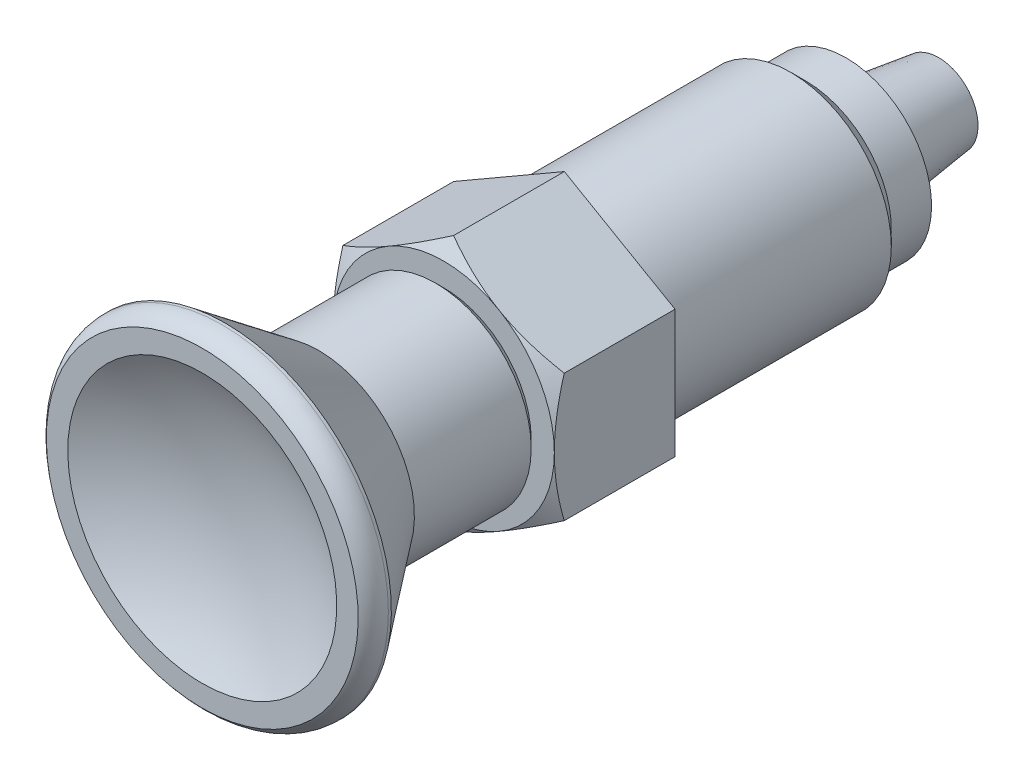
ISO-10303-21;
HEADER;
FILE_DESCRIPTION(('STEP AP214'),'2;1');
FILE_NAME('part.step','',(''),(''),'','','');
FILE_SCHEMA(('AUTOMOTIVE_DESIGN { 1 0 10303 214 1 1 1 1 }'));
ENDSEC;
DATA;
#1=APPLICATION_CONTEXT('core data for automotive mechanical design processes');
#2=APPLICATION_PROTOCOL_DEFINITION('international standard','automotive_design',2000,#1);
#3=PRODUCT_CONTEXT('',#1,'mechanical');
#4=PRODUCT('Part','Part','',(#3));
#5=PRODUCT_RELATED_PRODUCT_CATEGORY('part','',(#4));
#6=PRODUCT_DEFINITION_FORMATION('','',#4);
#7=PRODUCT_DEFINITION_CONTEXT('part definition',#1,'design');
#8=PRODUCT_DEFINITION('design','',#6,#7);
#9=PRODUCT_DEFINITION_SHAPE('','',#8);
#10=(LENGTH_UNIT() NAMED_UNIT(*) SI_UNIT(.MILLI.,.METRE.));
#11=(NAMED_UNIT(*) PLANE_ANGLE_UNIT() SI_UNIT($,.RADIAN.));
#12=(NAMED_UNIT(*) SI_UNIT($,.STERADIAN.) SOLID_ANGLE_UNIT());
#13=UNCERTAINTY_MEASURE_WITH_UNIT(LENGTH_MEASURE(1.E-05),#10,'distance_accuracy_value','');
#14=(GEOMETRIC_REPRESENTATION_CONTEXT(3) GLOBAL_UNCERTAINTY_ASSIGNED_CONTEXT((#13)) GLOBAL_UNIT_ASSIGNED_CONTEXT((#10,
#11,#12)) REPRESENTATION_CONTEXT('',''));
#15=CARTESIAN_POINT('',(0.,0.,0.));
#16=DIRECTION('',(0.,0.,1.));
#17=DIRECTION('',(1.,0.,0.));
#18=AXIS2_PLACEMENT_3D('',#15,#16,#17);
#19=CARTESIAN_POINT('',(0.,0.,-28.));
#20=DIRECTION('',(0.,0.,1.));
#21=DIRECTION('',(0.,1.,0.));
#22=AXIS2_PLACEMENT_3D('',#19,#20,#21);
#23=CYLINDRICAL_SURFACE('',#22,10.);
#24=CARTESIAN_POINT('',(0.,0.,0.));
#25=DIRECTION('',(0.,0.,1.));
#26=DIRECTION('',(0.,1.,0.));
#27=AXIS2_PLACEMENT_3D('',#24,#25,#26);
#28=CIRCLE('',#27,10.);
#29=CARTESIAN_POINT('',(0.,10.,0.));
#30=VERTEX_POINT('',#29);
#31=EDGE_CURVE('E359',#30,#30,#28,.T.);
#32=ORIENTED_EDGE('',*,*,#31,.F.);
#33=EDGE_LOOP('',(#32));
#34=FACE_BOUND('',#33,.T.);
#35=CARTESIAN_POINT('',(0.,0.,-22.5));
#36=DIRECTION('',(0.,0.,1.));
#37=DIRECTION('',(0.,1.,0.));
#38=AXIS2_PLACEMENT_3D('',#35,#36,#37);
#39=CIRCLE('',#38,10.);
#40=CARTESIAN_POINT('',(0.,10.,-22.5));
#41=VERTEX_POINT('',#40);
#42=EDGE_CURVE('E362',#41,#41,#39,.T.);
#43=ORIENTED_EDGE('',*,*,#42,.T.);
#44=EDGE_LOOP('',(#43));
#45=FACE_BOUND('',#44,.T.);
#46=ADVANCED_FACE('F14',(#34,#45),#23,.T.);
#47=CARTESIAN_POINT('',(-10.,0.,0.));
#48=DIRECTION('',(0.,0.,-1.));
#49=DIRECTION('',(0.,-1.,0.));
#50=AXIS2_PLACEMENT_3D('',#47,#48,#49);
#51=PLANE('',#50);
#52=ORIENTED_EDGE('',*,*,#31,.T.);
#53=EDGE_LOOP('',(#52));
#54=FACE_BOUND('',#53,.T.);
#55=DIRECTION('',(0.,1.,0.));
#56=VECTOR('',#55,1.);
#57=CARTESIAN_POINT('',(11.,-6.35085296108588,0.));
#58=LINE('',#57,#56);
#59=CARTESIAN_POINT('',(11.,-6.35085296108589,0.));
#60=VERTEX_POINT('',#59);
#61=CARTESIAN_POINT('',(11.,6.35085296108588,0.));
#62=VERTEX_POINT('',#61);
#63=EDGE_CURVE('E425',#60,#62,#58,.T.);
#64=ORIENTED_EDGE('',*,*,#63,.F.);
#65=DIRECTION('',(0.866025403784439,0.5,0.));
#66=VECTOR('',#65,1.);
#67=CARTESIAN_POINT('',(0.,-12.7017059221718,0.));
#68=LINE('',#67,#66);
#69=CARTESIAN_POINT('',(0.,-12.7017059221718,0.));
#70=VERTEX_POINT('',#69);
#71=EDGE_CURVE('E430',#70,#60,#68,.T.);
#72=ORIENTED_EDGE('',*,*,#71,.F.);
#73=DIRECTION('',(0.866025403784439,-0.5,0.));
#74=VECTOR('',#73,1.);
#75=CARTESIAN_POINT('',(-11.,-6.35085296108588,0.));
#76=LINE('',#75,#74);
#77=CARTESIAN_POINT('',(-11.,-6.35085296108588,0.));
#78=VERTEX_POINT('',#77);
#79=EDGE_CURVE('E376',#78,#70,#76,.T.);
#80=ORIENTED_EDGE('',*,*,#79,.F.);
#81=DIRECTION('',(0.,-1.,0.));
#82=VECTOR('',#81,1.);
#83=CARTESIAN_POINT('',(-11.,6.35085296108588,0.));
#84=LINE('',#83,#82);
#85=CARTESIAN_POINT('',(-11.,6.35085296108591,0.));
#86=VERTEX_POINT('',#85);
#87=EDGE_CURVE('E361',#86,#78,#84,.T.);
#88=ORIENTED_EDGE('',*,*,#87,.F.);
#89=DIRECTION('',(-0.866025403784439,-0.5,0.));
#90=VECTOR('',#89,1.);
#91=CARTESIAN_POINT('',(0.,12.7017059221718,0.));
#92=LINE('',#91,#90);
#93=CARTESIAN_POINT('',(0.,12.7017059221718,0.));
#94=VERTEX_POINT('',#93);
#95=EDGE_CURVE('E80',#94,#86,#92,.T.);
#96=ORIENTED_EDGE('',*,*,#95,.F.);
#97=DIRECTION('',(-0.866025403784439,0.5,0.));
#98=VECTOR('',#97,1.);
#99=CARTESIAN_POINT('',(11.,6.35085296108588,0.));
#100=LINE('',#99,#98);
#101=EDGE_CURVE('E77',#62,#94,#100,.T.);
#102=ORIENTED_EDGE('',*,*,#101,.F.);
#103=EDGE_LOOP('',(#64,#72,#80,#88,#96,#102));
#104=FACE_BOUND('',#103,.T.);
#105=ADVANCED_FACE('F196',(#54,#104),#51,.T.);
#106=CARTESIAN_POINT('',(-11.,6.35085296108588,0.));
#107=DIRECTION('',(-1.,0.,0.));
#108=DIRECTION('',(0.,-1.,0.));
#109=AXIS2_PLACEMENT_3D('',#106,#107,#108);
#110=PLANE('',#109);
#111=CARTESIAN_POINT('',(-11.,0.,12.));
#112=CARTESIAN_POINT('',(-11.,-0.269557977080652,12.0000452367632));
#113=CARTESIAN_POINT('',(-11.,-0.539103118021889,11.9942806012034));
#114=CARTESIAN_POINT('',(-11.,-1.07766414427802,11.9714665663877));
#115=CARTESIAN_POINT('',(-11.,-1.34668012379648,11.9544194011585));
#116=CARTESIAN_POINT('',(-11.,-1.88244489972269,11.9094875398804));
#117=CARTESIAN_POINT('',(-11.,-2.14919830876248,11.8816574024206));
#118=CARTESIAN_POINT('',(-11.,-2.68143540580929,11.8157540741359));
#119=CARTESIAN_POINT('',(-11.,-2.94691906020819,11.7776806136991));
#120=CARTESIAN_POINT('',(-11.,-3.47602099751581,11.692067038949));
#121=CARTESIAN_POINT('',(-11.,-3.73964114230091,11.6445383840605));
#122=CARTESIAN_POINT('',(-11.,-4.26516468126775,11.5407957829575));
#123=CARTESIAN_POINT('',(-11.,-4.52706796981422,11.4845813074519));
#124=CARTESIAN_POINT('',(-11.,-5.31266882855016,11.3035576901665));
#125=CARTESIAN_POINT('',(-11.,-5.83365883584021,11.1668042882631));
#126=CARTESIAN_POINT('',(-11.,-6.35085287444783,11.0175196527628));
#127=B_SPLINE_CURVE_WITH_KNOTS('',3,(#111,#112,#113,#114,#115,#116,#117,#118,#119,#120,#121,
#122,#123,#124,#125,#126),.UNSPECIFIED.,.F.,.F.,(4,2,2,2,2,2,2,4),(0.,0.808591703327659,
1.61702334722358,2.42141689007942,3.22583160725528,4.02927727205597,4.83277191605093,
6.44765254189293),.UNSPECIFIED.);
#128=CARTESIAN_POINT('',(-11.,0.,12.));
#129=VERTEX_POINT('',#128);
#130=CARTESIAN_POINT('',(-11.0000000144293,-6.35085295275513,11.0175196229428));
#131=VERTEX_POINT('',#130);
#132=EDGE_CURVE('E200',#129,#131,#127,.T.);
#133=ORIENTED_EDGE('',*,*,#132,.F.);
#134=CARTESIAN_POINT('',(-10.9999999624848,6.3508529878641,11.0175195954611));
#135=CARTESIAN_POINT('',(-10.9999999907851,5.8336589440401,11.1668042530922));
#136=CARTESIAN_POINT('',(-10.9999999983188,5.31266892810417,11.3035576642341));
#137=CARTESIAN_POINT('',(-11.0000000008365,4.52706805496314,11.4845812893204));
#138=CARTESIAN_POINT('',(-11.0000000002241,4.26516476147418,11.540795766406));
#139=CARTESIAN_POINT('',(-10.9999999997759,3.7396412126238,11.644538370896));
#140=CARTESIAN_POINT('',(-10.9999999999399,3.47602106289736,11.6920670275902));
#141=CARTESIAN_POINT('',(-11.0000000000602,2.94691911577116,11.7776806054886));
#142=CARTESIAN_POINT('',(-11.0000000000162,2.68143545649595,11.8157540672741));
#143=CARTESIAN_POINT('',(-10.9999999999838,2.14919834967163,11.8816573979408));
#144=CARTESIAN_POINT('',(-10.9999999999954,1.88244493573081,11.9094875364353));
#145=CARTESIAN_POINT('',(-11.0000000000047,1.34668014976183,11.9544193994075));
#146=CARTESIAN_POINT('',(-11.0000000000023,1.07766416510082,11.9714665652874));
#147=CARTESIAN_POINT('',(-10.9999999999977,0.539103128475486,11.9942806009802));
#148=CARTESIAN_POINT('',(-10.9999999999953,0.269557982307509,12.0000452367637));
#149=CARTESIAN_POINT('',(-11.,0.,12.));
#150=B_SPLINE_CURVE_WITH_KNOTS('',3,(#134,#135,#136,#137,#138,#139,#140,#141,#142,#143,#144,
#145,#146,#147,#148,#149),.UNSPECIFIED.,.F.,.F.,(4,2,2,2,2,2,2,4),(0.,1.61488065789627,
2.41837531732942,3.22182099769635,4.02623572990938,4.83062928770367,5.63906094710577,
6.44765266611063),.UNSPECIFIED.);
#151=CARTESIAN_POINT('',(-11.,6.35085297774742,11.0175196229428));
#152=VERTEX_POINT('',#151);
#153=EDGE_CURVE('E206',#152,#129,#150,.T.);
#154=ORIENTED_EDGE('',*,*,#153,.F.);
#155=DIRECTION('',(0.,0.,1.));
#156=VECTOR('',#155,1.);
#157=CARTESIAN_POINT('',(-11.,6.35085296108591,0.));
#158=LINE('',#157,#156);
#159=EDGE_CURVE('E264',#86,#152,#158,.T.);
#160=ORIENTED_EDGE('',*,*,#159,.F.);
#161=ORIENTED_EDGE('',*,*,#87,.T.);
#162=DIRECTION('',(0.,0.,1.));
#163=VECTOR('',#162,1.);
#164=CARTESIAN_POINT('',(-11.,-6.35085296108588,0.));
#165=LINE('',#164,#163);
#166=EDGE_CURVE('E366',#131,#78,#165,.F.);
#167=ORIENTED_EDGE('',*,*,#166,.F.);
#168=EDGE_LOOP('',(#133,#154,#160,#161,#167));
#169=FACE_BOUND('',#168,.T.);
#170=ADVANCED_FACE('F190',(#169),#110,.T.);
#171=CARTESIAN_POINT('',(-11.,-6.35085296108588,0.));
#172=DIRECTION('',(-0.5,-0.866025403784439,0.));
#173=DIRECTION('',(0.866025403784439,-0.5,0.));
#174=AXIS2_PLACEMENT_3D('',#171,#172,#173);
#175=PLANE('',#174);
#176=CARTESIAN_POINT('',(-5.5,-9.52627944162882,12.));
#177=CARTESIAN_POINT('',(-5.26655594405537,-9.66105843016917,12.0000452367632));
#178=CARTESIAN_POINT('',(-5.03312300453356,-9.79583100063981,11.9942806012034));
#179=CARTESIAN_POINT('',(-4.56671547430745,-10.0651115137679,11.9714665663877));
#180=CARTESIAN_POINT('',(-4.33374080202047,-10.1996195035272,11.9544194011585));
#181=CARTESIAN_POINT('',(-3.86975489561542,-10.4675018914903,11.9094875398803));
#182=CARTESIAN_POINT('',(-3.63873966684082,-10.6008785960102,11.8816574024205));
#183=CARTESIAN_POINT('',(-3.17780881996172,-10.8669971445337,11.8157540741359));
#184=CARTESIAN_POINT('',(-2.9478932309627,-10.9997389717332,11.777680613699));
#185=CARTESIAN_POINT('',(-2.48967751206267,-11.264289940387,11.6920670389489));
#186=CARTESIAN_POINT('',(-2.2613757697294,-11.3961000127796,11.6445383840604));
#187=CARTESIAN_POINT('',(-1.80625903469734,-11.6588617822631,11.5407957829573));
#188=CARTESIAN_POINT('',(-1.57944413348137,-11.7898134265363,11.4845813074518));
#189=CARTESIAN_POINT('',(-0.899093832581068,-12.1826138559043,11.3035576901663));
#190=CARTESIAN_POINT('',(-0.447903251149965,-12.4431088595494,11.1668042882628));
#191=CARTESIAN_POINT('',(-7.50298244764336E-08,-12.7017058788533,11.0175196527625));
#192=B_SPLINE_CURVE_WITH_KNOTS('',3,(#176,#177,#178,#179,#180,#181,#182,#183,#184,#185,#186,
#187,#188,#189,#190,#191),.UNSPECIFIED.,.F.,.F.,(4,2,2,2,2,2,2,4),(0.,0.8085917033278,
1.61702334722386,2.42141689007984,3.22583160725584,4.02927727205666,4.83277191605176,
6.44765254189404),.UNSPECIFIED.);
#193=CARTESIAN_POINT('',(-5.5,-9.52627944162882,12.));
#194=VERTEX_POINT('',#193);
#195=CARTESIAN_POINT('',(-1.4428809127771E-08,-12.7017059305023,11.0175196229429));
#196=VERTEX_POINT('',#195);
#197=EDGE_CURVE('E173',#194,#196,#192,.T.);
#198=ORIENTED_EDGE('',*,*,#197,.F.);
#199=CARTESIAN_POINT('',(-11.000000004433,-6.35085291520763,11.0175195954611));
#200=CARTESIAN_POINT('',(-10.5520968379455,-6.60944996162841,11.1668042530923));
#201=CARTESIAN_POINT('',(-10.1009062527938,-6.86994497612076,11.3035576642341));
#202=CARTESIAN_POINT('',(-9.42055594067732,-7.2627454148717,11.4845812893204));
#203=CARTESIAN_POINT('',(-9.1937410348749,-7.39369706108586,11.540795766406));
#204=CARTESIAN_POINT('',(-8.73862429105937,-7.65645883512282,11.644538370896));
#205=CARTESIAN_POINT('',(-8.51032254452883,-7.78826891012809,11.6920670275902));
#206=CARTESIAN_POINT('',(-8.05210681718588,-8.05281988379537,11.7776806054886));
#207=CARTESIAN_POINT('',(-7.82219122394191,-8.18556171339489,11.8157540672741));
#208=CARTESIAN_POINT('',(-7.36126036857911,-8.45168026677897,11.8816573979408));
#209=CARTESIAN_POINT('',(-7.13024513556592,-8.5850569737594,11.9094875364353));
#210=CARTESIAN_POINT('',(-6.6662592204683,-8.85293936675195,11.9544193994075));
#211=CARTESIAN_POINT('',(-6.43328454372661,-8.98744735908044,11.9714665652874));
#212=CARTESIAN_POINT('',(-5.96687700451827,-9.25672787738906,11.9942806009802));
#213=CARTESIAN_POINT('',(-5.73344406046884,-9.39150045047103,12.0000452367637));
#214=CARTESIAN_POINT('',(-5.5,-9.52627944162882,12.));
#215=B_SPLINE_CURVE_WITH_KNOTS('',3,(#199,#200,#201,#202,#203,#204,#205,#206,#207,#208,#209,
#210,#211,#212,#213,#214),.UNSPECIFIED.,.F.,.F.,(4,2,2,2,2,2,2,4),(0.,1.61488065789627,
2.41837531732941,3.22182099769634,4.02623572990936,4.83062928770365,5.63906094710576,
6.44765266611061),.UNSPECIFIED.);
#216=EDGE_CURVE('E180',#131,#194,#215,.T.);
#217=ORIENTED_EDGE('',*,*,#216,.F.);
#218=ORIENTED_EDGE('',*,*,#166,.T.);
#219=ORIENTED_EDGE('',*,*,#79,.T.);
#220=DIRECTION('',(0.,0.,1.));
#221=VECTOR('',#220,1.);
#222=CARTESIAN_POINT('',(0.,-12.7017059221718,0.));
#223=LINE('',#222,#221);
#224=EDGE_CURVE('E441',#196,#70,#223,.F.);
#225=ORIENTED_EDGE('',*,*,#224,.F.);
#226=EDGE_LOOP('',(#198,#217,#218,#219,#225));
#227=FACE_BOUND('',#226,.T.);
#228=ADVANCED_FACE('F186',(#227),#175,.T.);
#229=CARTESIAN_POINT('',(0.,-12.7017059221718,0.));
#230=DIRECTION('',(0.5,-0.866025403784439,0.));
#231=DIRECTION('',(0.866025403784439,0.5,0.));
#232=AXIS2_PLACEMENT_3D('',#229,#230,#231);
#233=PLANE('',#232);
#234=CARTESIAN_POINT('',(5.5,-9.52627944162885,12.));
#235=CARTESIAN_POINT('',(5.73344405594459,-9.39150045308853,12.0000452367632));
#236=CARTESIAN_POINT('',(5.96687699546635,-9.25672788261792,11.9942806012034));
#237=CARTESIAN_POINT('',(6.43328452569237,-8.98744736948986,11.9714665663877));
#238=CARTESIAN_POINT('',(6.66625919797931,-8.85293937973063,11.9544194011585));
#239=CARTESIAN_POINT('',(7.13024510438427,-8.58505699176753,11.9094875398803));
#240=CARTESIAN_POINT('',(7.36126033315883,-8.45168028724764,11.8816574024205));
#241=CARTESIAN_POINT('',(7.82219118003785,-8.18556173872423,11.8157540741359));
#242=CARTESIAN_POINT('',(8.05210676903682,-8.05281991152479,11.7776806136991));
#243=CARTESIAN_POINT('',(8.51032248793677,-7.78826894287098,11.692067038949));
#244=CARTESIAN_POINT('',(8.73862423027,-7.65645887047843,11.6445383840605));
#245=CARTESIAN_POINT('',(9.19374096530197,-7.39369710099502,11.5407957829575));
#246=CARTESIAN_POINT('',(9.4205558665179,-7.26274545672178,11.4845813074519));
#247=CARTESIAN_POINT('',(10.1009061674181,-6.86994502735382,11.3035576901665));
#248=CARTESIAN_POINT('',(10.5520967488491,-6.6094500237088,11.1668042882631));
#249=CARTESIAN_POINT('',(10.9999999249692,-6.35085300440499,11.0175196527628));
#250=B_SPLINE_CURVE_WITH_KNOTS('',3,(#234,#235,#236,#237,#238,#239,#240,#241,#242,#243,#244,
#245,#246,#247,#248,#249),.UNSPECIFIED.,.F.,.F.,(4,2,2,2,2,2,2,4),(0.,0.808591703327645,
1.61702334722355,2.42141689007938,3.22583160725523,4.0292772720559,4.83277191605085,
6.44765254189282),.UNSPECIFIED.);
#251=CARTESIAN_POINT('',(5.5,-9.52627944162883,12.));
#252=VERTEX_POINT('',#251);
#253=CARTESIAN_POINT('',(11.,-6.35085297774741,11.0175196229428));
#254=VERTEX_POINT('',#253);
#255=EDGE_CURVE('E145',#252,#254,#250,.T.);
#256=ORIENTED_EDGE('',*,*,#255,.F.);
#257=CARTESIAN_POINT('',(-4.19471447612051E-08,-12.7017059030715,11.0175195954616));
#258=CARTESIAN_POINT('',(0.447903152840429,-12.4431089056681,11.1668042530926));
#259=CARTESIAN_POINT('',(0.89909374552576,-12.1826139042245,11.3035576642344));
#260=CARTESIAN_POINT('',(1.57944406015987,-11.7898134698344,11.4845812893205));
#261=CARTESIAN_POINT('',(1.8062589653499,-11.6588618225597,11.5407957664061));
#262=CARTESIAN_POINT('',(2.26137570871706,-11.3961000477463,11.6445383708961));
#263=CARTESIAN_POINT('',(2.48967745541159,-11.2642899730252,11.6920670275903));
#264=CARTESIAN_POINT('',(2.94789318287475,-10.9997389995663,11.7776806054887));
#265=CARTESIAN_POINT('',(3.17780877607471,-10.8669971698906,11.8157540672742));
#266=CARTESIAN_POINT('',(3.63873963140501,-10.6008786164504,11.8816573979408));
#267=CARTESIAN_POINT('',(3.86975486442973,-10.4675019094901,11.9094875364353));
#268=CARTESIAN_POINT('',(4.33374077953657,-10.1996195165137,11.9544193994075));
#269=CARTESIAN_POINT('',(4.56671545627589,-10.0651115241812,11.9714665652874));
#270=CARTESIAN_POINT('',(5.03312299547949,-9.79583100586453,11.9942806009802));
#271=CARTESIAN_POINT('',(5.26655593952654,-9.66105843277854,12.0000452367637));
#272=CARTESIAN_POINT('',(5.5,-9.52627944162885,12.));
#273=B_SPLINE_CURVE_WITH_KNOTS('',3,(#257,#258,#259,#260,#261,#262,#263,#264,#265,#266,#267,
#268,#269,#270,#271,#272),.UNSPECIFIED.,.F.,.F.,(4,2,2,2,2,2,2,4),(0.,1.61488065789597,
2.41837531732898,3.22182099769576,4.02623572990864,4.83062928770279,5.63906094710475,
6.44765266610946),.UNSPECIFIED.);
#274=EDGE_CURVE('E167',#196,#252,#273,.T.);
#275=ORIENTED_EDGE('',*,*,#274,.F.);
#276=ORIENTED_EDGE('',*,*,#224,.T.);
#277=ORIENTED_EDGE('',*,*,#71,.T.);
#278=DIRECTION('',(0.,0.,1.));
#279=VECTOR('',#278,1.);
#280=CARTESIAN_POINT('',(11.,-6.35085296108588,0.));
#281=LINE('',#280,#279);
#282=EDGE_CURVE('E435',#254,#60,#281,.F.);
#283=ORIENTED_EDGE('',*,*,#282,.F.);
#284=EDGE_LOOP('',(#256,#275,#276,#277,#283));
#285=FACE_BOUND('',#284,.T.);
#286=ADVANCED_FACE('F127',(#285),#233,.T.);
#287=CARTESIAN_POINT('',(11.,-6.35085296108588,0.));
#288=DIRECTION('',(1.,0.,0.));
#289=DIRECTION('',(0.,1.,0.));
#290=AXIS2_PLACEMENT_3D('',#287,#288,#289);
#291=PLANE('',#290);
#292=CARTESIAN_POINT('',(11.,0.,12.));
#293=CARTESIAN_POINT('',(11.,0.269557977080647,12.0000452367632));
#294=CARTESIAN_POINT('',(11.,0.539103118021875,11.9942806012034));
#295=CARTESIAN_POINT('',(11.,1.07766414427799,11.9714665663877));
#296=CARTESIAN_POINT('',(11.,1.34668012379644,11.9544194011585));
#297=CARTESIAN_POINT('',(11.,1.88244489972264,11.9094875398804));
#298=CARTESIAN_POINT('',(11.,2.14919830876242,11.8816574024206));
#299=CARTESIAN_POINT('',(11.,2.68143540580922,11.8157540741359));
#300=CARTESIAN_POINT('',(11.,2.94691906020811,11.7776806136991));
#301=CARTESIAN_POINT('',(11.,3.47602099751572,11.692067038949));
#302=CARTESIAN_POINT('',(11.,3.73964114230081,11.6445383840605));
#303=CARTESIAN_POINT('',(11.,4.26516468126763,11.5407957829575));
#304=CARTESIAN_POINT('',(11.,4.5270679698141,11.484581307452));
#305=CARTESIAN_POINT('',(11.,5.31266882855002,11.3035576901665));
#306=CARTESIAN_POINT('',(11.,5.83365883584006,11.1668042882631));
#307=CARTESIAN_POINT('',(11.,6.35085287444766,11.0175196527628));
#308=B_SPLINE_CURVE_WITH_KNOTS('',3,(#292,#293,#294,#295,#296,#297,#298,#299,#300,#301,#302,
#303,#304,#305,#306,#307),.UNSPECIFIED.,.F.,.F.,(4,2,2,2,2,2,2,4),(0.,0.808591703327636,
1.61702334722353,2.42141689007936,3.22583160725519,4.02927727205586,4.8327719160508,
6.44765254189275),.UNSPECIFIED.);
#309=CARTESIAN_POINT('',(11.,0.,12.));
#310=VERTEX_POINT('',#309);
#311=CARTESIAN_POINT('',(11.0000000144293,6.35085295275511,11.0175196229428));
#312=VERTEX_POINT('',#311);
#313=EDGE_CURVE('E95',#310,#312,#308,.T.);
#314=ORIENTED_EDGE('',*,*,#313,.F.);
#315=CARTESIAN_POINT('',(10.9999999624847,-6.35085298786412,11.017519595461));
#316=CARTESIAN_POINT('',(10.999999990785,-5.83365894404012,11.1668042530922));
#317=CARTESIAN_POINT('',(10.9999999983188,-5.31266892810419,11.3035576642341));
#318=CARTESIAN_POINT('',(11.0000000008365,-4.52706805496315,11.4845812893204));
#319=CARTESIAN_POINT('',(11.0000000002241,-4.26516476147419,11.5407957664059));
#320=CARTESIAN_POINT('',(10.9999999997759,-3.73964121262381,11.644538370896));
#321=CARTESIAN_POINT('',(10.9999999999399,-3.47602106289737,11.6920670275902));
#322=CARTESIAN_POINT('',(11.0000000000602,-2.94691911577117,11.7776806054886));
#323=CARTESIAN_POINT('',(11.0000000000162,-2.68143545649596,11.8157540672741));
#324=CARTESIAN_POINT('',(10.9999999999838,-2.14919834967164,11.8816573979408));
#325=CARTESIAN_POINT('',(10.9999999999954,-1.88244493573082,11.9094875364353));
#326=CARTESIAN_POINT('',(11.0000000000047,-1.34668014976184,11.9544193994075));
#327=CARTESIAN_POINT('',(11.0000000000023,-1.07766416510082,11.9714665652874));
#328=CARTESIAN_POINT('',(10.9999999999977,-0.539103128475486,11.9942806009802));
#329=CARTESIAN_POINT('',(10.9999999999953,-0.269557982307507,12.0000452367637));
#330=CARTESIAN_POINT('',(11.,0.,12.));
#331=B_SPLINE_CURVE_WITH_KNOTS('',3,(#315,#316,#317,#318,#319,#320,#321,#322,#323,#324,#325,
#326,#327,#328,#329,#330),.UNSPECIFIED.,.F.,.F.,(4,2,2,2,2,2,2,4),(0.,1.61488065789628,
2.41837531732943,3.22182099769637,4.0262357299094,4.83062928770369,5.6390609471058,
6.44765266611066),.UNSPECIFIED.);
#332=EDGE_CURVE('E137',#254,#310,#331,.T.);
#333=ORIENTED_EDGE('',*,*,#332,.F.);
#334=ORIENTED_EDGE('',*,*,#282,.T.);
#335=ORIENTED_EDGE('',*,*,#63,.T.);
#336=DIRECTION('',(0.,0.,1.));
#337=VECTOR('',#336,1.);
#338=CARTESIAN_POINT('',(11.,6.35085296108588,0.));
#339=LINE('',#338,#337);
#340=EDGE_CURVE('E434',#312,#62,#339,.F.);
#341=ORIENTED_EDGE('',*,*,#340,.F.);
#342=EDGE_LOOP('',(#314,#333,#334,#335,#341));
#343=FACE_BOUND('',#342,.T.);
#344=ADVANCED_FACE('F120',(#343),#291,.T.);
#345=CARTESIAN_POINT('',(11.,6.35085296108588,0.));
#346=DIRECTION('',(0.5,0.866025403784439,0.));
#347=DIRECTION('',(-0.866025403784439,0.5,0.));
#348=AXIS2_PLACEMENT_3D('',#345,#346,#347);
#349=PLANE('',#348);
#350=CARTESIAN_POINT('',(5.5,9.52627944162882,12.));
#351=CARTESIAN_POINT('',(5.26655594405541,9.66105843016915,12.0000452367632));
#352=CARTESIAN_POINT('',(5.03312300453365,9.79583100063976,11.9942806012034));
#353=CARTESIAN_POINT('',(4.56671547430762,10.0651115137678,11.9714665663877));
#354=CARTESIAN_POINT('',(4.33374080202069,10.1996195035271,11.9544194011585));
#355=CARTESIAN_POINT('',(3.86975489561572,10.4675018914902,11.9094875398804));
#356=CARTESIAN_POINT('',(3.63873966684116,10.60087859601,11.8816574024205));
#357=CARTESIAN_POINT('',(3.17780881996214,10.8669971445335,11.8157540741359));
#358=CARTESIAN_POINT('',(2.94789323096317,10.9997389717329,11.7776806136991));
#359=CARTESIAN_POINT('',(2.48967751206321,11.2642899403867,11.692067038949));
#360=CARTESIAN_POINT('',(2.26137576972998,11.3961000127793,11.6445383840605));
#361=CARTESIAN_POINT('',(1.80625903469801,11.6588617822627,11.5407957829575));
#362=CARTESIAN_POINT('',(1.57944413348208,11.7898134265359,11.484581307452));
#363=CARTESIAN_POINT('',(0.899093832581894,12.1826138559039,11.3035576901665));
#364=CARTESIAN_POINT('',(0.447903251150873,12.4431088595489,11.1668042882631));
#365=CARTESIAN_POINT('',(7.50308107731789E-08,12.7017058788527,11.0175196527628));
#366=B_SPLINE_CURVE_WITH_KNOTS('',3,(#350,#351,#352,#353,#354,#355,#356,#357,#358,#359,#360,
#361,#362,#363,#364,#365),.UNSPECIFIED.,.F.,.F.,(4,2,2,2,2,2,2,4),(0.,0.80859170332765,
1.61702334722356,2.4214168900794,3.22583160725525,4.02927727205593,4.83277191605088,
6.44765254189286),.UNSPECIFIED.);
#367=CARTESIAN_POINT('',(5.5,9.52627944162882,12.));
#368=VERTEX_POINT('',#367);
#369=CARTESIAN_POINT('',(1.44292992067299E-08,12.7017059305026,11.0175196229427));
#370=VERTEX_POINT('',#369);
#371=EDGE_CURVE('E34',#368,#370,#366,.T.);
#372=ORIENTED_EDGE('',*,*,#371,.F.);
#373=CARTESIAN_POINT('',(11.000000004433,6.35085291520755,11.017519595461));
#374=CARTESIAN_POINT('',(10.5520968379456,6.60944996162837,11.1668042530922));
#375=CARTESIAN_POINT('',(10.1009062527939,6.86994497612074,11.3035576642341));
#376=CARTESIAN_POINT('',(9.42055594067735,7.26274541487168,11.4845812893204));
#377=CARTESIAN_POINT('',(9.19374103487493,7.39369706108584,11.5407957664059));
#378=CARTESIAN_POINT('',(8.7386242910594,7.6564588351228,11.644538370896));
#379=CARTESIAN_POINT('',(8.51032254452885,7.78826891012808,11.6920670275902));
#380=CARTESIAN_POINT('',(8.0521068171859,8.05281988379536,11.7776806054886));
#381=CARTESIAN_POINT('',(7.82219122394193,8.18556171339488,11.8157540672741));
#382=CARTESIAN_POINT('',(7.36126036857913,8.45168026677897,11.8816573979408));
#383=CARTESIAN_POINT('',(7.13024513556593,8.58505697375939,11.9094875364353));
#384=CARTESIAN_POINT('',(6.66625922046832,8.85293936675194,11.9544193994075));
#385=CARTESIAN_POINT('',(6.43328454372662,8.98744735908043,11.9714665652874));
#386=CARTESIAN_POINT('',(5.96687700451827,9.25672787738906,11.9942806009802));
#387=CARTESIAN_POINT('',(5.73344406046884,9.39150045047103,12.0000452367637));
#388=CARTESIAN_POINT('',(5.5,9.52627944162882,12.));
#389=B_SPLINE_CURVE_WITH_KNOTS('',3,(#373,#374,#375,#376,#377,#378,#379,#380,#381,#382,#383,
#384,#385,#386,#387,#388),.UNSPECIFIED.,.F.,.F.,(4,2,2,2,2,2,2,4),(0.,1.61488065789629,
2.41837531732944,3.22182099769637,4.0262357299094,4.8306292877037,5.63906094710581,
6.44765266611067),.UNSPECIFIED.);
#390=EDGE_CURVE('E93',#312,#368,#389,.T.);
#391=ORIENTED_EDGE('',*,*,#390,.F.);
#392=ORIENTED_EDGE('',*,*,#340,.T.);
#393=ORIENTED_EDGE('',*,*,#101,.T.);
#394=DIRECTION('',(0.,0.,1.));
#395=VECTOR('',#394,1.);
#396=CARTESIAN_POINT('',(0.,12.7017059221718,0.));
#397=LINE('',#396,#395);
#398=EDGE_CURVE('E72',#370,#94,#397,.F.);
#399=ORIENTED_EDGE('',*,*,#398,.F.);
#400=EDGE_LOOP('',(#372,#391,#392,#393,#399));
#401=FACE_BOUND('',#400,.T.);
#402=ADVANCED_FACE('F73',(#401),#349,.T.);
#403=CARTESIAN_POINT('',(0.,12.7017059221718,0.));
#404=DIRECTION('',(-0.5,0.866025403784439,0.));
#405=DIRECTION('',(-0.866025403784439,-0.5,0.));
#406=AXIS2_PLACEMENT_3D('',#403,#404,#405);
#407=PLANE('',#406);
#408=CARTESIAN_POINT('',(-5.5,9.52627944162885,12.));
#409=CARTESIAN_POINT('',(-5.73344405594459,9.39150045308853,12.0000452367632));
#410=CARTESIAN_POINT('',(-5.96687699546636,9.25672788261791,11.9942806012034));
#411=CARTESIAN_POINT('',(-6.43328452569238,8.98744736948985,11.9714665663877));
#412=CARTESIAN_POINT('',(-6.66625919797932,8.85293937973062,11.9544194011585));
#413=CARTESIAN_POINT('',(-7.1302451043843,8.58505699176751,11.9094875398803));
#414=CARTESIAN_POINT('',(-7.36126033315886,8.45168028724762,11.8816574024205));
#415=CARTESIAN_POINT('',(-7.82219118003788,8.18556173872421,11.8157540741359));
#416=CARTESIAN_POINT('',(-8.05210676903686,8.05281991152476,11.7776806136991));
#417=CARTESIAN_POINT('',(-8.51032248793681,7.78826894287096,11.692067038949));
#418=CARTESIAN_POINT('',(-8.73862423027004,7.65645887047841,11.6445383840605));
#419=CARTESIAN_POINT('',(-9.19374096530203,7.39369710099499,11.5407957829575));
#420=CARTESIAN_POINT('',(-9.42055586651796,7.26274545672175,11.4845813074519));
#421=CARTESIAN_POINT('',(-10.1009061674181,6.86994502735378,11.3035576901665));
#422=CARTESIAN_POINT('',(-10.5520967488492,6.60945002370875,11.1668042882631));
#423=CARTESIAN_POINT('',(-10.9999999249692,6.35085300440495,11.0175196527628));
#424=B_SPLINE_CURVE_WITH_KNOTS('',3,(#408,#409,#410,#411,#412,#413,#414,#415,#416,#417,#418,
#419,#420,#421,#422,#423),.UNSPECIFIED.,.F.,.F.,(4,2,2,2,2,2,2,4),(0.,0.808591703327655,
1.61702334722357,2.42141689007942,3.22583160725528,4.02927727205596,4.83277191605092,
6.44765254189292),.UNSPECIFIED.);
#425=CARTESIAN_POINT('',(-5.5,9.52627944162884,12.));
#426=VERTEX_POINT('',#425);
#427=EDGE_CURVE('E68',#426,#152,#424,.T.);
#428=ORIENTED_EDGE('',*,*,#427,.F.);
#429=CARTESIAN_POINT('',(4.19482499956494E-08,12.7017059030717,11.017519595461));
#430=CARTESIAN_POINT('',(-0.447903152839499,12.4431089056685,11.1668042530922));
#431=CARTESIAN_POINT('',(-0.899093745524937,12.182613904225,11.3035576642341));
#432=CARTESIAN_POINT('',(-1.57944406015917,11.7898134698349,11.4845812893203));
#433=CARTESIAN_POINT('',(-1.80625896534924,11.6588618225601,11.5407957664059));
#434=CARTESIAN_POINT('',(-2.26137570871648,11.3961000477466,11.644538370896));
#435=CARTESIAN_POINT('',(-2.48967745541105,11.2642899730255,11.6920670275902));
#436=CARTESIAN_POINT('',(-2.9478931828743,10.9997389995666,11.7776806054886));
#437=CARTESIAN_POINT('',(-3.17780877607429,10.8669971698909,11.8157540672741));
#438=CARTESIAN_POINT('',(-3.63873963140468,10.6008786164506,11.8816573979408));
#439=CARTESIAN_POINT('',(-3.86975486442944,10.4675019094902,11.9094875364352));
#440=CARTESIAN_POINT('',(-4.33374077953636,10.1996195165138,11.9544193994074));
#441=CARTESIAN_POINT('',(-4.56671545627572,10.0651115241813,11.9714665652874));
#442=CARTESIAN_POINT('',(-5.0331229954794,9.79583100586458,11.9942806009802));
#443=CARTESIAN_POINT('',(-5.26655593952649,9.66105843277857,12.0000452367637));
#444=CARTESIAN_POINT('',(-5.5,9.52627944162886,12.));
#445=B_SPLINE_CURVE_WITH_KNOTS('',3,(#429,#430,#431,#432,#433,#434,#435,#436,#437,#438,#439,
#440,#441,#442,#443,#444),.UNSPECIFIED.,.F.,.F.,(4,2,2,2,2,2,2,4),(0.,1.61488065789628,
2.41837531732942,3.22182099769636,4.02623572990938,4.83062928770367,5.63906094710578,
6.44765266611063),.UNSPECIFIED.);
#446=EDGE_CURVE('E83',#370,#426,#445,.T.);
#447=ORIENTED_EDGE('',*,*,#446,.F.);
#448=ORIENTED_EDGE('',*,*,#398,.T.);
#449=ORIENTED_EDGE('',*,*,#95,.T.);
#450=ORIENTED_EDGE('',*,*,#159,.T.);
#451=EDGE_LOOP('',(#428,#447,#448,#449,#450));
#452=FACE_BOUND('',#451,.T.);
#453=ADVANCED_FACE('F84',(#452),#407,.T.);
#454=CARTESIAN_POINT('',(0.,0.,11.0116247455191));
#455=DIRECTION('',(0.,0.,-1.));
#456=DIRECTION('',(0.,-1.,0.));
#457=AXIS2_PLACEMENT_3D('',#454,#455,#456);
#458=CONICAL_SURFACE('',#457,12.7119161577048,1.0471975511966);
#459=ORIENTED_EDGE('',*,*,#153,.T.);
#460=CARTESIAN_POINT('',(0.,0.,12.));
#461=DIRECTION('',(0.,0.,-1.));
#462=DIRECTION('',(0.,-1.,0.));
#463=AXIS2_PLACEMENT_3D('',#460,#461,#462);
#464=CIRCLE('',#463,11.);
#465=EDGE_CURVE('E88',#426,#129,#464,.F.);
#466=ORIENTED_EDGE('',*,*,#465,.F.);
#467=ORIENTED_EDGE('',*,*,#427,.T.);
#468=EDGE_LOOP('',(#459,#466,#467));
#469=FACE_BOUND('',#468,.T.);
#470=ADVANCED_FACE('F218',(#469),#458,.T.);
#471=CARTESIAN_POINT('',(0.,0.,11.0116247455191));
#472=DIRECTION('',(0.,0.,-1.));
#473=DIRECTION('',(0.,-1.,0.));
#474=AXIS2_PLACEMENT_3D('',#471,#472,#473);
#475=CONICAL_SURFACE('',#474,12.7119161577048,1.0471975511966);
#476=ORIENTED_EDGE('',*,*,#132,.T.);
#477=ORIENTED_EDGE('',*,*,#216,.T.);
#478=CARTESIAN_POINT('',(0.,0.,12.));
#479=DIRECTION('',(0.,0.,-1.));
#480=DIRECTION('',(0.,-1.,0.));
#481=AXIS2_PLACEMENT_3D('',#478,#479,#480);
#482=CIRCLE('',#481,11.);
#483=EDGE_CURVE('E462',#129,#194,#482,.F.);
#484=ORIENTED_EDGE('',*,*,#483,.F.);
#485=EDGE_LOOP('',(#476,#477,#484));
#486=FACE_BOUND('',#485,.T.);
#487=ADVANCED_FACE('F163',(#486),#475,.T.);
#488=CARTESIAN_POINT('',(0.,0.,11.011624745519));
#489=DIRECTION('',(0.,0.,-1.));
#490=DIRECTION('',(-1.,0.,0.));
#491=AXIS2_PLACEMENT_3D('',#488,#489,#490);
#492=CONICAL_SURFACE('',#491,12.7119161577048,1.0471975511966);
#493=ORIENTED_EDGE('',*,*,#197,.T.);
#494=ORIENTED_EDGE('',*,*,#274,.T.);
#495=CARTESIAN_POINT('',(0.,0.,12.));
#496=DIRECTION('',(0.,0.,-1.));
#497=DIRECTION('',(-1.,0.,0.));
#498=AXIS2_PLACEMENT_3D('',#495,#496,#497);
#499=CIRCLE('',#498,11.);
#500=EDGE_CURVE('E460',#194,#252,#499,.F.);
#501=ORIENTED_EDGE('',*,*,#500,.F.);
#502=EDGE_LOOP('',(#493,#494,#501));
#503=FACE_BOUND('',#502,.T.);
#504=ADVANCED_FACE('F156',(#503),#492,.T.);
#505=CARTESIAN_POINT('',(0.,0.,11.0116247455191));
#506=DIRECTION('',(0.,0.,-1.));
#507=DIRECTION('',(0.,-1.,0.));
#508=AXIS2_PLACEMENT_3D('',#505,#506,#507);
#509=CONICAL_SURFACE('',#508,12.7119161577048,1.0471975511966);
#510=ORIENTED_EDGE('',*,*,#255,.T.);
#511=ORIENTED_EDGE('',*,*,#332,.T.);
#512=CARTESIAN_POINT('',(0.,0.,12.));
#513=DIRECTION('',(0.,0.,-1.));
#514=DIRECTION('',(0.,-1.,0.));
#515=AXIS2_PLACEMENT_3D('',#512,#513,#514);
#516=CIRCLE('',#515,11.);
#517=EDGE_CURVE('E454',#252,#310,#516,.F.);
#518=ORIENTED_EDGE('',*,*,#517,.F.);
#519=EDGE_LOOP('',(#510,#511,#518));
#520=FACE_BOUND('',#519,.T.);
#521=ADVANCED_FACE('F151',(#520),#509,.T.);
#522=CARTESIAN_POINT('',(0.,0.,11.0116247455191));
#523=DIRECTION('',(0.,0.,-1.));
#524=DIRECTION('',(0.,-1.,0.));
#525=AXIS2_PLACEMENT_3D('',#522,#523,#524);
#526=CONICAL_SURFACE('',#525,12.7119161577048,1.0471975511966);
#527=ORIENTED_EDGE('',*,*,#390,.T.);
#528=CARTESIAN_POINT('',(0.,0.,12.));
#529=DIRECTION('',(0.,0.,-1.));
#530=DIRECTION('',(0.,-1.,0.));
#531=AXIS2_PLACEMENT_3D('',#528,#529,#530);
#532=CIRCLE('',#531,11.);
#533=EDGE_CURVE('E456',#310,#368,#532,.F.);
#534=ORIENTED_EDGE('',*,*,#533,.F.);
#535=ORIENTED_EDGE('',*,*,#313,.T.);
#536=EDGE_LOOP('',(#527,#534,#535));
#537=FACE_BOUND('',#536,.T.);
#538=ADVANCED_FACE('F155',(#537),#526,.T.);
#539=CARTESIAN_POINT('',(0.,0.,11.011624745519));
#540=DIRECTION('',(0.,0.,-1.));
#541=DIRECTION('',(-1.,0.,0.));
#542=AXIS2_PLACEMENT_3D('',#539,#540,#541);
#543=CONICAL_SURFACE('',#542,12.7119161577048,1.0471975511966);
#544=ORIENTED_EDGE('',*,*,#446,.T.);
#545=CARTESIAN_POINT('',(0.,0.,12.));
#546=DIRECTION('',(0.,0.,-1.));
#547=DIRECTION('',(-1.,0.,0.));
#548=AXIS2_PLACEMENT_3D('',#545,#546,#547);
#549=CIRCLE('',#548,11.);
#550=EDGE_CURVE('E91',#368,#426,#549,.F.);
#551=ORIENTED_EDGE('',*,*,#550,.F.);
#552=ORIENTED_EDGE('',*,*,#371,.T.);
#553=EDGE_LOOP('',(#544,#551,#552));
#554=FACE_BOUND('',#553,.T.);
#555=ADVANCED_FACE('F90',(#554),#543,.T.);
#556=CARTESIAN_POINT('',(0.,0.,58.3));
#557=DIRECTION('',(1.,0.,0.));
#558=DIRECTION('',(0.,-1.,0.));
#559=AXIS2_PLACEMENT_3D('',#556,#557,#558);
#560=SPHERICAL_SURFACE('',#559,26.);
#561=CARTESIAN_POINT('',(0.,-13.3682459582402,36.));
#562=CARTESIAN_POINT('',(0.375585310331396,-13.3682486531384,36.));
#563=CARTESIAN_POINT('',(0.751126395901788,-13.3524111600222,36.));
#564=CARTESIAN_POINT('',(1.49966463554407,-13.2891717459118,36.));
#565=CARTESIAN_POINT('',(1.87266109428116,-13.2417615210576,36.));
#566=CARTESIAN_POINT('',(2.61372997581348,-13.1156339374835,36.));
#567=CARTESIAN_POINT('',(2.98179666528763,-13.0368829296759,36.));
#568=CARTESIAN_POINT('',(3.70998226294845,-12.8486360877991,36.));
#569=CARTESIAN_POINT('',(4.07010119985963,-12.7391403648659,36.));
#570=CARTESIAN_POINT('',(4.77965529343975,-12.4902434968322,36.));
#571=CARTESIAN_POINT('',(5.12909553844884,-12.3508568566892,36.));
#572=CARTESIAN_POINT('',(5.8149955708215,-12.0431356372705,36.));
#573=CARTESIAN_POINT('',(6.15145515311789,-11.8748006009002,36.));
#574=CARTESIAN_POINT('',(6.80891126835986,-11.5104276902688,36.));
#575=CARTESIAN_POINT('',(7.12991172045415,-11.314396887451,36.));
#576=CARTESIAN_POINT('',(7.75425858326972,-10.8959942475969,36.));
#577=CARTESIAN_POINT('',(8.05760506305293,-10.673622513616,36.));
#578=CARTESIAN_POINT('',(8.64452045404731,-10.2040929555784,36.));
#579=CARTESIAN_POINT('',(8.92808725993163,-9.95693249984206,36.));
#580=CARTESIAN_POINT('',(9.4733922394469,-9.43960204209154,36.));
#581=CARTESIAN_POINT('',(9.7351303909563,-9.16943201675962,36.));
#582=CARTESIAN_POINT('',(10.2349267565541,-8.60799236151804,36.));
#583=CARTESIAN_POINT('',(10.472984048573,-8.31672191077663,36.));
#584=CARTESIAN_POINT('',(10.9237145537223,-7.7151616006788,36.));
#585=CARTESIAN_POINT('',(11.1363877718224,-7.40487174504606,36.));
#586=CARTESIAN_POINT('',(11.5348344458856,-6.76748455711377,36.));
#587=CARTESIAN_POINT('',(11.7206084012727,-6.44038753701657,36.));
#588=CARTESIAN_POINT('',(12.063940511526,-5.77170618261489,36.));
#589=CARTESIAN_POINT('',(12.2214986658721,-5.43012184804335,36.));
#590=CARTESIAN_POINT('',(12.5072787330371,-4.73489504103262,36.));
#591=CARTESIAN_POINT('',(12.6355007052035,-4.38125259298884,36.));
#592=CARTESIAN_POINT('',(12.8616972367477,-3.66442308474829,36.));
#593=CARTESIAN_POINT('',(12.9596717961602,-3.30123602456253,36.));
#594=CARTESIAN_POINT('',(13.1246771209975,-2.56789862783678,36.));
#595=CARTESIAN_POINT('',(13.1917078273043,-2.19774827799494,36.));
#596=CARTESIAN_POINT('',(13.2943486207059,-1.45311652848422,36.));
#597=CARTESIAN_POINT('',(13.3299587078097,-1.07863512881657,36.));
#598=CARTESIAN_POINT('',(13.3695050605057,-0.328004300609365,36.));
#599=CARTESIAN_POINT('',(13.373441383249,0.0481451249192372,36.));
#600=CARTESIAN_POINT('',(13.3496123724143,0.7994384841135,36.));
#601=CARTESIAN_POINT('',(13.3218470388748,1.17458241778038,36.));
#602=CARTESIAN_POINT('',(13.2348120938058,1.92119788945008,36.));
#603=CARTESIAN_POINT('',(13.1755424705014,2.29266942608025,36.));
#604=CARTESIAN_POINT('',(13.0259203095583,3.02929902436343,36.));
#605=CARTESIAN_POINT('',(12.9355677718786,3.39445708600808,36.));
#606=CARTESIAN_POINT('',(12.7244220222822,4.11586406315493,36.));
#607=CARTESIAN_POINT('',(12.6036287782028,4.47211296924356,36.));
#608=CARTESIAN_POINT('',(12.3324604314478,5.17316851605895,36.));
#609=CARTESIAN_POINT('',(12.182085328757,5.51797515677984,36.));
#610=CARTESIAN_POINT('',(11.8528223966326,6.19369469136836,36.));
#611=CARTESIAN_POINT('',(11.6739345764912,6.5246075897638,36.));
#612=CARTESIAN_POINT('',(11.2889179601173,7.17018716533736,36.));
#613=CARTESIAN_POINT('',(11.0827891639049,7.48485384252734,36.));
#614=CARTESIAN_POINT('',(10.644756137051,8.09570375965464,36.));
#615=CARTESIAN_POINT('',(10.4128519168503,8.39188700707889,36.));
#616=CARTESIAN_POINT('',(9.92491667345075,8.96366451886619,36.));
#617=CARTESIAN_POINT('',(9.66888565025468,9.23925878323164,36.));
#618=CARTESIAN_POINT('',(9.13451699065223,9.76789905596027,36.));
#619=CARTESIAN_POINT('',(8.85617935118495,10.0209450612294,36.));
#620=CARTESIAN_POINT('',(8.2791763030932,10.5026897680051,36.));
#621=CARTESIAN_POINT('',(7.98051089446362,10.7313884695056,36.));
#622=CARTESIAN_POINT('',(7.36497559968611,11.1628126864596,36.));
#623=CARTESIAN_POINT('',(7.04810571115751,11.3655381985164,36.));
#624=CARTESIAN_POINT('',(6.39841424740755,11.7435747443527,36.));
#625=CARTESIAN_POINT('',(6.06559267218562,11.9188857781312,36.));
#626=CARTESIAN_POINT('',(5.38636401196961,12.2408470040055,36.));
#627=CARTESIAN_POINT('',(5.03995692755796,12.3874971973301,36.));
#628=CARTESIAN_POINT('',(4.33601998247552,12.6510941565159,36.));
#629=CARTESIAN_POINT('',(3.9784901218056,12.7680409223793,36.));
#630=CARTESIAN_POINT('',(3.25484946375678,12.9713996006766,36.));
#631=CARTESIAN_POINT('',(2.8887386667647,13.0578115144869,36.));
#632=CARTESIAN_POINT('',(2.15053894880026,13.1994861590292,36.));
#633=CARTESIAN_POINT('',(1.77845002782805,13.2547488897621,36.));
#634=CARTESIAN_POINT('',(1.03093939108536,13.3337322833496,36.));
#635=CARTESIAN_POINT('',(0.655517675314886,13.3574529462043,36.));
#636=CARTESIAN_POINT('',(-0.0959895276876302,13.3731835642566,36.));
#637=CARTESIAN_POINT('',(-0.472075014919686,13.3651935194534,36.));
#638=CARTESIAN_POINT('',(-1.22223603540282,13.3175595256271,36.));
#639=CARTESIAN_POINT('',(-1.5963115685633,13.277915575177,36.));
#640=CARTESIAN_POINT('',(-2.33979321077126,13.1672556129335,36.));
#641=CARTESIAN_POINT('',(-2.70919931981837,13.0962396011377,36.));
#642=CARTESIAN_POINT('',(-3.44071587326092,12.9233403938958,36.));
#643=CARTESIAN_POINT('',(-3.80282631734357,12.8214571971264,36.));
#644=CARTESIAN_POINT('',(-4.51717713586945,12.5875479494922,36.));
#645=CARTESIAN_POINT('',(-4.86941751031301,12.4555218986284,36.));
#646=CARTESIAN_POINT('',(-5.56152392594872,12.1622655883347,36.));
#647=CARTESIAN_POINT('',(-5.90138996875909,12.001035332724,36.));
#648=CARTESIAN_POINT('',(-6.56633152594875,11.6505168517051,36.));
#649=CARTESIAN_POINT('',(-6.89140704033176,11.461228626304,36.));
#650=CARTESIAN_POINT('',(-7.52445640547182,11.0559399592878,36.));
#651=CARTESIAN_POINT('',(-7.83243025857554,10.8399395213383,36.));
#652=CARTESIAN_POINT('',(-8.42908684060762,10.3827620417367,36.));
#653=CARTESIAN_POINT('',(-8.71776956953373,10.1415850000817,36.));
#654=CARTESIAN_POINT('',(-9.27379165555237,9.63576883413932,36.));
#655=CARTESIAN_POINT('',(-9.54113100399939,9.37112970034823,36.));
#656=CARTESIAN_POINT('',(-10.0525655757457,8.82027085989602,36.));
#657=CARTESIAN_POINT('',(-10.296660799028,8.53405115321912,36.));
#658=CARTESIAN_POINT('',(-10.7598718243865,7.9420659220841,36.));
#659=CARTESIAN_POINT('',(-10.9789876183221,7.63630039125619,36.));
#660=CARTESIAN_POINT('',(-11.3906819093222,7.0073974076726,36.));
#661=CARTESIAN_POINT('',(-11.5832604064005,6.68425995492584,36.));
#662=CARTESIAN_POINT('',(-11.9405107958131,6.02291079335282,36.));
#663=CARTESIAN_POINT('',(-12.1051827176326,5.68469910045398,36.));
#664=CARTESIAN_POINT('',(-12.405449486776,4.9956056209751,36.));
#665=CARTESIAN_POINT('',(-12.5410443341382,4.64472383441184,36.));
#666=CARTESIAN_POINT('',(-12.782192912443,3.93278485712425,36.));
#667=CARTESIAN_POINT('',(-12.8877466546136,3.5717276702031,36.));
#668=CARTESIAN_POINT('',(-13.0680626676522,2.84200466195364,36.));
#669=CARTESIAN_POINT('',(-13.1428249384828,2.4733388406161,36.));
#670=CARTESIAN_POINT('',(-13.2610266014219,1.73101888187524,36.));
#671=CARTESIAN_POINT('',(-13.3044659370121,1.35736473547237,36.));
#672=CARTESIAN_POINT('',(-13.3597126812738,0.607725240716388,36.));
#673=CARTESIAN_POINT('',(-13.3715200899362,0.231739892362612,36.));
#674=CARTESIAN_POINT('',(-13.3634190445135,-0.519888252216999,36.));
#675=CARTESIAN_POINT('',(-13.3435106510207,-0.895531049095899,36.));
#676=CARTESIAN_POINT('',(-13.2721196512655,-1.64380422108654,36.));
#677=CARTESIAN_POINT('',(-13.2206370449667,-2.01643459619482,36.));
#678=CARTESIAN_POINT('',(-13.0864634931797,-2.75603450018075,36.));
#679=CARTESIAN_POINT('',(-13.0037724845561,-3.12300401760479,36.));
#680=CARTESIAN_POINT('',(-12.8077700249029,-3.84867248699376,36.));
#681=CARTESIAN_POINT('',(-12.6944585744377,-4.20737143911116,36.));
#682=CARTESIAN_POINT('',(-12.4380184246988,-4.91395521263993,36.));
#683=CARTESIAN_POINT('',(-12.2948891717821,-5.26183983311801,36.));
#684=CARTESIAN_POINT('',(-11.9798322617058,-5.94431469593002,36.));
#685=CARTESIAN_POINT('',(-11.8079045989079,-6.27890493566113,36.));
#686=CARTESIAN_POINT('',(-11.4364804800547,-6.93239940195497,36.));
#687=CARTESIAN_POINT('',(-11.2369850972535,-7.25130423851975,36.));
#688=CARTESIAN_POINT('',(-10.8118388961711,-7.87117441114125,36.));
#689=CARTESIAN_POINT('',(-10.5861881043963,-8.17213976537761,36.));
#690=CARTESIAN_POINT('',(-10.110360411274,-8.75396077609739,36.));
#691=CARTESIAN_POINT('',(-9.86018611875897,-9.03481856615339,36.));
#692=CARTESIAN_POINT('',(-9.33706848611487,-9.57446448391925,36.));
#693=CARTESIAN_POINT('',(-9.06412505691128,-9.83325252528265,36.));
#694=CARTESIAN_POINT('',(-8.49733759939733,-10.3269813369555,36.));
#695=CARTESIAN_POINT('',(-8.20348826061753,-10.5619160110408,36.));
#696=CARTESIAN_POINT('',(-7.59704532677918,-11.0061886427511,36.));
#697=CARTESIAN_POINT('',(-7.28445202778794,-11.2155270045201,36.));
#698=CARTESIAN_POINT('',(-6.6425836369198,-11.6072177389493,36.));
#699=CARTESIAN_POINT('',(-6.31330053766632,-11.7895569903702,36.));
#700=CARTESIAN_POINT('',(-5.64053678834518,-12.1258308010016,36.));
#701=CARTESIAN_POINT('',(-5.2970560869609,-12.2797652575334,36.));
#702=CARTESIAN_POINT('',(-4.59871120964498,-12.5579840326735,36.));
#703=CARTESIAN_POINT('',(-4.24385967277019,-12.682300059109,36.));
#704=CARTESIAN_POINT('',(-3.5250673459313,-12.9005804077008,36.));
#705=CARTESIAN_POINT('',(-3.16112897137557,-12.99455270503,36.));
#706=CARTESIAN_POINT('',(-2.33514245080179,-13.1710678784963,36.));
#707=CARTESIAN_POINT('',(-1.87121744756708,-13.2449469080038,36.));
#708=CARTESIAN_POINT('',(-0.938171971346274,-13.3435342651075,36.));
#709=CARTESIAN_POINT('',(-0.46905149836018,-13.3682425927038,36.));
#710=CARTESIAN_POINT('',(0.,-13.3682459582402,36.));
#711=B_SPLINE_CURVE_WITH_KNOTS('',3,(#561,#562,#563,#564,#565,#566,#567,#568,#569,#570,#571,
#572,#573,#574,#575,#576,#577,#578,#579,#580,#581,#582,#583,#584,#585,#586,#587,#588,#589,#590,
#591,#592,#593,#594,#595,#596,#597,#598,#599,#600,#601,#602,#603,#604,#605,#606,#607,#608,#609,
#610,#611,#612,#613,#614,#615,#616,#617,#618,#619,#620,#621,#622,#623,#624,#625,#626,#627,#628,
#629,#630,#631,#632,#633,#634,#635,#636,#637,#638,#639,#640,#641,#642,#643,#644,#645,#646,#647,
#648,#649,#650,#651,#652,#653,#654,#655,#656,#657,#658,#659,#660,#661,#662,#663,#664,#665,#666,
#667,#668,#669,#670,#671,#672,#673,#674,#675,#676,#677,#678,#679,#680,#681,#682,#683,#684,#685,
#686,#687,#688,#689,#690,#691,#692,#693,#694,#695,#696,#697,#698,#699,#700,#701,#702,#703,#704,
#705,#706,#707,#708,#709,#710),.UNSPECIFIED.,.T.,.F.,(4,2,2,2,2,2,2,2,2,2,2,2,2,2,2,2,2,2,2,2,2,
2,2,2,2,2,2,2,2,2,2,2,2,2,2,2,2,2,2,2,2,2,2,2,2,2,2,2,2,2,2,2,2,2,2,2,2,2,2,2,2,2,2,2,2,2,2,2,2,
2,2,2,2,2,4),(0.,1.12634621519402,2.25298878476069,3.38084425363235,4.50869564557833,
5.63600096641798,6.76332408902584,7.89035989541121,9.01739129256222,10.1445424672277,
11.2716947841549,12.3988909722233,13.5260869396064,14.6532619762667,15.7804370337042,
16.907609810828,18.0347825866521,19.1619575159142,20.2891324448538,21.4163053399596,
22.5434782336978,23.6706515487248,24.7978248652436,25.9249993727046,27.0521738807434,
28.1793480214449,29.3065221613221,30.4336958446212,31.5608695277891,32.6880433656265,
33.8152172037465,34.9423911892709,36.0695651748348,37.1967391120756,38.3239130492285,
39.4510869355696,40.5782608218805,41.7054347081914,42.8326085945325,43.9597825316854,
45.0869564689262,46.2141304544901,47.3413044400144,48.4684782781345,49.5956521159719,
50.7228257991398,51.8499994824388,52.9771736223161,54.1043477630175,55.2315222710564,
56.3586967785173,57.4858700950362,58.6130434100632,59.7402163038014,60.8673891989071,
61.9945641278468,63.1217390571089,64.248911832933,65.3760846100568,66.5032596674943,
67.6304347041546,68.7576306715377,69.8848268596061,71.0119791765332,72.1391303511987,
73.2661617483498,74.3931975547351,75.520520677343,76.6478259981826,77.7756773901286,
78.9035328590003,80.0301754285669,81.1565216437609,82.5631644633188,83.9698072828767),.UNSPECIFIED.);
#712=CARTESIAN_POINT('',(0.,-13.3682459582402,36.));
#713=VERTEX_POINT('',#712);
#714=EDGE_CURVE('E272',#713,#713,#711,.T.);
#715=ORIENTED_EDGE('',*,*,#714,.T.);
#716=EDGE_LOOP('',(#715));
#717=FACE_BOUND('',#716,.T.);
#718=ADVANCED_FACE('F265',(#717),#560,.F.);
#719=CARTESIAN_POINT('',(-11.,0.,12.));
#720=DIRECTION('',(0.,0.,1.));
#721=DIRECTION('',(0.,1.,0.));
#722=AXIS2_PLACEMENT_3D('',#719,#720,#721);
#723=PLANE('',#722);
#724=ORIENTED_EDGE('',*,*,#533,.T.);
#725=ORIENTED_EDGE('',*,*,#550,.T.);
#726=ORIENTED_EDGE('',*,*,#465,.T.);
#727=ORIENTED_EDGE('',*,*,#483,.T.);
#728=ORIENTED_EDGE('',*,*,#500,.T.);
#729=ORIENTED_EDGE('',*,*,#517,.T.);
#730=EDGE_LOOP('',(#724,#725,#726,#727,#728,#729));
#731=FACE_BOUND('',#730,.T.);
#732=CARTESIAN_POINT('',(0.,0.,12.));
#733=DIRECTION('',(0.,0.,1.));
#734=DIRECTION('',(1.,0.,0.));
#735=AXIS2_PLACEMENT_3D('',#732,#733,#734);
#736=CIRCLE('',#735,8.7);
#737=CARTESIAN_POINT('',(8.7,0.,12.));
#738=VERTEX_POINT('',#737);
#739=EDGE_CURVE('E279',#738,#738,#736,.T.);
#740=ORIENTED_EDGE('',*,*,#739,.F.);
#741=EDGE_LOOP('',(#740));
#742=FACE_BOUND('',#741,.T.);
#743=ADVANCED_FACE('F269',(#731,#742),#723,.T.);
#744=CARTESIAN_POINT('',(-13.36824595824,0.,36.));
#745=DIRECTION('',(0.,0.,-1.));
#746=DIRECTION('',(0.,-1.,0.));
#747=AXIS2_PLACEMENT_3D('',#744,#745,#746);
#748=PLANE('',#747);
#749=ORIENTED_EDGE('',*,*,#714,.F.);
#750=EDGE_LOOP('',(#749));
#751=FACE_BOUND('',#750,.T.);
#752=CARTESIAN_POINT('',(0.,0.,36.));
#753=DIRECTION('',(0.,0.,-1.));
#754=DIRECTION('',(0.,-1.,0.));
#755=AXIS2_PLACEMENT_3D('',#752,#753,#754);
#756=CIRCLE('',#755,15.5);
#757=CARTESIAN_POINT('',(0.,-15.5,36.));
#758=VERTEX_POINT('',#757);
#759=EDGE_CURVE('E297',#758,#758,#756,.T.);
#760=ORIENTED_EDGE('',*,*,#759,.F.);
#761=EDGE_LOOP('',(#760));
#762=FACE_BOUND('',#761,.T.);
#763=ADVANCED_FACE('F282',(#751,#762),#748,.F.);
#764=CARTESIAN_POINT('',(0.,0.,12.8));
#765=DIRECTION('',(0.,0.,1.));
#766=DIRECTION('',(1.,0.,0.));
#767=AXIS2_PLACEMENT_3D('',#764,#765,#766);
#768=CONICAL_SURFACE('',#767,9.5,0.785398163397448);
#769=CARTESIAN_POINT('',(0.,0.,12.8));
#770=DIRECTION('',(0.,0.,1.));
#771=DIRECTION('',(0.,1.,0.));
#772=AXIS2_PLACEMENT_3D('',#769,#770,#771);
#773=CIRCLE('',#772,9.5);
#774=CARTESIAN_POINT('',(0.,9.5,12.8));
#775=VERTEX_POINT('',#774);
#776=EDGE_CURVE('E299',#775,#775,#773,.T.);
#777=ORIENTED_EDGE('',*,*,#776,.F.);
#778=EDGE_LOOP('',(#777));
#779=FACE_BOUND('',#778,.T.);
#780=ORIENTED_EDGE('',*,*,#739,.T.);
#781=EDGE_LOOP('',(#780));
#782=FACE_BOUND('',#781,.T.);
#783=ADVANCED_FACE('F254',(#779,#782),#768,.T.);
#784=CARTESIAN_POINT('',(0.,0.,34.));
#785=DIRECTION('',(0.,0.,-1.));
#786=DIRECTION('',(0.,-1.,0.));
#787=AXIS2_PLACEMENT_3D('',#784,#785,#786);
#788=TOROIDAL_SURFACE('',#787,14.,2.5);
#789=CARTESIAN_POINT('',(0.,0.,34.));
#790=DIRECTION('',(0.,0.,1.));
#791=DIRECTION('',(0.,1.,0.));
#792=AXIS2_PLACEMENT_3D('',#789,#790,#791);
#793=CIRCLE('',#792,16.5);
#794=CARTESIAN_POINT('',(0.,16.5,34.));
#795=VERTEX_POINT('',#794);
#796=EDGE_CURVE('E301',#795,#795,#793,.F.);
#797=ORIENTED_EDGE('',*,*,#796,.F.);
#798=EDGE_LOOP('',(#797));
#799=FACE_BOUND('',#798,.T.);
#800=ORIENTED_EDGE('',*,*,#759,.T.);
#801=EDGE_LOOP('',(#800));
#802=FACE_BOUND('',#801,.T.);
#803=ADVANCED_FACE('F249',(#799,#802),#788,.T.);
#804=CARTESIAN_POINT('',(0.,0.,-38.));
#805=DIRECTION('',(0.,0.,1.));
#806=DIRECTION('',(0.,1.,0.));
#807=AXIS2_PLACEMENT_3D('',#804,#805,#806);
#808=CYLINDRICAL_SURFACE('',#807,9.5);
#809=CARTESIAN_POINT('',(0.,0.,24.4106862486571));
#810=DIRECTION('',(0.,0.,1.));
#811=DIRECTION('',(0.,1.,0.));
#812=AXIS2_PLACEMENT_3D('',#809,#810,#811);
#813=CIRCLE('',#812,9.5);
#814=CARTESIAN_POINT('',(0.,9.5,24.4106862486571));
#815=VERTEX_POINT('',#814);
#816=EDGE_CURVE('E25',#815,#815,#813,.T.);
#817=ORIENTED_EDGE('',*,*,#816,.F.);
#818=EDGE_LOOP('',(#817));
#819=FACE_BOUND('',#818,.T.);
#820=ORIENTED_EDGE('',*,*,#776,.T.);
#821=EDGE_LOOP('',(#820));
#822=FACE_BOUND('',#821,.T.);
#823=ADVANCED_FACE('F242',(#819,#822),#808,.T.);
#824=CARTESIAN_POINT('',(0.,0.,-38.));
#825=DIRECTION('',(0.,0.,1.));
#826=DIRECTION('',(0.,1.,0.));
#827=AXIS2_PLACEMENT_3D('',#824,#825,#826);
#828=CYLINDRICAL_SURFACE('',#827,16.5);
#829=ORIENTED_EDGE('',*,*,#796,.T.);
#830=EDGE_LOOP('',(#829));
#831=FACE_BOUND('',#830,.T.);
#832=CARTESIAN_POINT('',(0.,0.,33.7));
#833=DIRECTION('',(0.,0.,1.));
#834=DIRECTION('',(0.,1.,0.));
#835=AXIS2_PLACEMENT_3D('',#832,#833,#834);
#836=CIRCLE('',#835,16.5);
#837=CARTESIAN_POINT('',(0.,16.5,33.7));
#838=VERTEX_POINT('',#837);
#839=EDGE_CURVE('E9',#838,#838,#836,.F.);
#840=ORIENTED_EDGE('',*,*,#839,.F.);
#841=EDGE_LOOP('',(#840));
#842=FACE_BOUND('',#841,.T.);
#843=ADVANCED_FACE('F232',(#831,#842),#828,.T.);
#844=CARTESIAN_POINT('',(0.,0.,33.7));
#845=DIRECTION('',(0.,0.,1.));
#846=DIRECTION('',(1.,0.,0.));
#847=AXIS2_PLACEMENT_3D('',#844,#845,#846);
#848=CONICAL_SURFACE('',#847,16.5,0.645771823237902);
#849=ORIENTED_EDGE('',*,*,#839,.T.);
#850=EDGE_LOOP('',(#849));
#851=FACE_BOUND('',#850,.T.);
#852=ORIENTED_EDGE('',*,*,#816,.T.);
#853=EDGE_LOOP('',(#852));
#854=FACE_BOUND('',#853,.T.);
#855=ADVANCED_FACE('F230',(#851,#854),#848,.T.);
#856=CARTESIAN_POINT('',(0.,0.,-28.));
#857=DIRECTION('',(1.,0.,0.));
#858=DIRECTION('',(0.,-1.,0.));
#859=AXIS2_PLACEMENT_3D('',#856,#857,#858);
#860=SPHERICAL_SURFACE('',#859,10.);
#861=CARTESIAN_POINT('',(0.,0.,-37.1994285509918));
#862=DIRECTION('',(0.,0.,1.));
#863=DIRECTION('',(0.,1.,0.));
#864=AXIS2_PLACEMENT_3D('',#861,#862,#863);
#865=CIRCLE('',#864,3.92052475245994);
#866=CARTESIAN_POINT('',(0.,3.92052475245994,-37.1994285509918));
#867=VERTEX_POINT('',#866);
#868=EDGE_CURVE('E19',#867,#867,#865,.T.);
#869=ORIENTED_EDGE('',*,*,#868,.F.);
#870=EDGE_LOOP('',(#869));
#871=FACE_BOUND('',#870,.T.);
#872=ADVANCED_FACE('F16',(#871),#860,.T.);
#873=CARTESIAN_POINT('',(0.,0.,-29.0000000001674));
#874=DIRECTION('',(0.,0.,1.));
#875=DIRECTION('',(0.,1.,0.));
#876=AXIS2_PLACEMENT_3D('',#873,#874,#875);
#877=CONICAL_SURFACE('',#876,4.99999999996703,0.130899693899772);
#878=CARTESIAN_POINT('',(0.,0.,-29.));
#879=DIRECTION('',(0.,0.,1.));
#880=DIRECTION('',(0.,1.,0.));
#881=AXIS2_PLACEMENT_3D('',#878,#879,#880);
#882=CIRCLE('',#881,5.);
#883=CARTESIAN_POINT('',(0.,5.,-29.));
#884=VERTEX_POINT('',#883);
#885=EDGE_CURVE('E307',#884,#884,#882,.T.);
#886=ORIENTED_EDGE('',*,*,#885,.F.);
#887=EDGE_LOOP('',(#886));
#888=FACE_BOUND('',#887,.T.);
#889=ORIENTED_EDGE('',*,*,#868,.T.);
#890=EDGE_LOOP('',(#889));
#891=FACE_BOUND('',#890,.T.);
#892=ADVANCED_FACE('F240',(#888,#891),#877,.T.);
#893=CARTESIAN_POINT('',(0.,0.,-38.));
#894=DIRECTION('',(0.,0.,1.));
#895=DIRECTION('',(0.,1.,0.));
#896=AXIS2_PLACEMENT_3D('',#893,#894,#895);
#897=CYLINDRICAL_SURFACE('',#896,5.);
#898=CARTESIAN_POINT('',(0.,0.,-28.3732050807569));
#899=DIRECTION('',(0.,0.,-1.));
#900=DIRECTION('',(0.,-1.,0.));
#901=AXIS2_PLACEMENT_3D('',#898,#899,#900);
#902=CIRCLE('',#901,5.);
#903=CARTESIAN_POINT('',(0.,-5.,-28.3732050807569));
#904=VERTEX_POINT('',#903);
#905=EDGE_CURVE('E310',#904,#904,#902,.T.);
#906=ORIENTED_EDGE('',*,*,#905,.T.);
#907=EDGE_LOOP('',(#906));
#908=FACE_BOUND('',#907,.T.);
#909=ORIENTED_EDGE('',*,*,#885,.T.);
#910=EDGE_LOOP('',(#909));
#911=FACE_BOUND('',#910,.T.);
#912=ADVANCED_FACE('F329',(#908,#911),#897,.T.);
#913=CARTESIAN_POINT('',(0.,0.,-28.2));
#914=DIRECTION('',(0.,0.,-1.));
#915=DIRECTION('',(0.,-1.,0.));
#916=AXIS2_PLACEMENT_3D('',#913,#914,#915);
#917=TOROIDAL_SURFACE('',#916,5.1,0.2);
#918=CARTESIAN_POINT('',(0.,0.,-28.));
#919=DIRECTION('',(0.,0.,-1.));
#920=DIRECTION('',(0.,-1.,0.));
#921=AXIS2_PLACEMENT_3D('',#918,#919,#920);
#922=CIRCLE('',#921,5.1);
#923=CARTESIAN_POINT('',(0.,-5.1,-28.));
#924=VERTEX_POINT('',#923);
#925=EDGE_CURVE('E340',#924,#924,#922,.T.);
#926=ORIENTED_EDGE('',*,*,#925,.T.);
#927=EDGE_LOOP('',(#926));
#928=FACE_BOUND('',#927,.T.);
#929=ORIENTED_EDGE('',*,*,#905,.F.);
#930=EDGE_LOOP('',(#929));
#931=FACE_BOUND('',#930,.T.);
#932=ADVANCED_FACE('F317',(#928,#931),#917,.F.);
#933=CARTESIAN_POINT('',(-5.2,0.,-28.));
#934=DIRECTION('',(0.,0.,1.));
#935=DIRECTION('',(0.,1.,0.));
#936=AXIS2_PLACEMENT_3D('',#933,#934,#935);
#937=PLANE('',#936);
#938=CARTESIAN_POINT('',(0.,0.,-27.9999999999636));
#939=DIRECTION('',(0.,0.,1.));
#940=DIRECTION('',(0.,1.,0.));
#941=AXIS2_PLACEMENT_3D('',#938,#939,#940);
#942=CIRCLE('',#941,5.19999999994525);
#943=CARTESIAN_POINT('',(0.,5.19999999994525,-27.9999999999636));
#944=VERTEX_POINT('',#943);
#945=EDGE_CURVE('E344',#944,#944,#942,.T.);
#946=ORIENTED_EDGE('',*,*,#945,.F.);
#947=EDGE_LOOP('',(#946));
#948=FACE_BOUND('',#947,.T.);
#949=ORIENTED_EDGE('',*,*,#925,.F.);
#950=EDGE_LOOP('',(#949));
#951=FACE_BOUND('',#950,.T.);
#952=ADVANCED_FACE('F328',(#948,#951),#937,.F.);
#953=CARTESIAN_POINT('',(0.,0.,-27.6999999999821));
#954=DIRECTION('',(0.,0.,1.));
#955=DIRECTION('',(0.,1.,0.));
#956=AXIS2_PLACEMENT_3D('',#953,#954,#955);
#957=CONICAL_SURFACE('',#956,5.49999999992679,0.785398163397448);
#958=CARTESIAN_POINT('',(0.,0.,-27.7));
#959=DIRECTION('',(0.,0.,1.));
#960=DIRECTION('',(0.,1.,0.));
#961=AXIS2_PLACEMENT_3D('',#958,#959,#960);
#962=CIRCLE('',#961,5.5);
#963=CARTESIAN_POINT('',(0.,5.5,-27.7));
#964=VERTEX_POINT('',#963);
#965=EDGE_CURVE('E347',#964,#964,#962,.F.);
#966=ORIENTED_EDGE('',*,*,#965,.T.);
#967=EDGE_LOOP('',(#966));
#968=FACE_BOUND('',#967,.T.);
#969=ORIENTED_EDGE('',*,*,#945,.T.);
#970=EDGE_LOOP('',(#969));
#971=FACE_BOUND('',#970,.T.);
#972=ADVANCED_FACE('F385',(#968,#971),#957,.T.);
#973=CARTESIAN_POINT('',(0.,0.,-28.));
#974=DIRECTION('',(0.,0.,1.));
#975=DIRECTION('',(0.,1.,0.));
#976=AXIS2_PLACEMENT_3D('',#973,#974,#975);
#977=CYLINDRICAL_SURFACE('',#976,5.5);
#978=ORIENTED_EDGE('',*,*,#965,.F.);
#979=EDGE_LOOP('',(#978));
#980=FACE_BOUND('',#979,.T.);
#981=CARTESIAN_POINT('',(0.,0.,-28.));
#982=DIRECTION('',(0.,0.,1.));
#983=DIRECTION('',(0.,1.,0.));
#984=AXIS2_PLACEMENT_3D('',#981,#982,#983);
#985=CIRCLE('',#984,5.5);
#986=CARTESIAN_POINT('',(0.,5.5,-28.));
#987=VERTEX_POINT('',#986);
#988=EDGE_CURVE('E351',#987,#987,#985,.T.);
#989=ORIENTED_EDGE('',*,*,#988,.F.);
#990=EDGE_LOOP('',(#989));
#991=FACE_BOUND('',#990,.T.);
#992=ADVANCED_FACE('F391',(#980,#991),#977,.F.);
#993=CARTESIAN_POINT('',(-5.5,0.,-28.));
#994=DIRECTION('',(0.,0.,-1.));
#995=DIRECTION('',(0.,-1.,0.));
#996=AXIS2_PLACEMENT_3D('',#993,#994,#995);
#997=PLANE('',#996);
#998=ORIENTED_EDGE('',*,*,#988,.T.);
#999=EDGE_LOOP('',(#998));
#1000=FACE_BOUND('',#999,.T.);
#1001=CARTESIAN_POINT('',(0.,0.,-28.));
#1002=DIRECTION('',(0.,0.,1.));
#1003=DIRECTION('',(0.,1.,0.));
#1004=AXIS2_PLACEMENT_3D('',#1001,#1002,#1003);
#1005=CIRCLE('',#1004,8.5);
#1006=CARTESIAN_POINT('',(0.,8.5,-28.));
#1007=VERTEX_POINT('',#1006);
#1008=EDGE_CURVE('E356',#1007,#1007,#1005,.T.);
#1009=ORIENTED_EDGE('',*,*,#1008,.F.);
#1010=EDGE_LOOP('',(#1009));
#1011=FACE_BOUND('',#1010,.T.);
#1012=ADVANCED_FACE('F397',(#1000,#1011),#997,.T.);
#1013=CARTESIAN_POINT('',(0.,0.,-28.));
#1014=DIRECTION('',(0.,0.,1.));
#1015=DIRECTION('',(0.,1.,0.));
#1016=AXIS2_PLACEMENT_3D('',#1013,#1014,#1015);
#1017=CYLINDRICAL_SURFACE('',#1016,8.5);
#1018=ORIENTED_EDGE('',*,*,#1008,.T.);
#1019=EDGE_LOOP('',(#1018));
#1020=FACE_BOUND('',#1019,.T.);
#1021=CARTESIAN_POINT('',(0.,0.,-24.));
#1022=DIRECTION('',(0.,0.,1.));
#1023=DIRECTION('',(0.,1.,0.));
#1024=AXIS2_PLACEMENT_3D('',#1021,#1022,#1023);
#1025=CIRCLE('',#1024,8.5);
#1026=CARTESIAN_POINT('',(0.,8.5,-24.));
#1027=VERTEX_POINT('',#1026);
#1028=EDGE_CURVE('E358',#1027,#1027,#1025,.T.);
#1029=ORIENTED_EDGE('',*,*,#1028,.F.);
#1030=EDGE_LOOP('',(#1029));
#1031=FACE_BOUND('',#1030,.T.);
#1032=ADVANCED_FACE('F403',(#1020,#1031),#1017,.T.);
#1033=CARTESIAN_POINT('',(0.,0.,-22.5));
#1034=DIRECTION('',(0.,0.,1.));
#1035=DIRECTION('',(0.,1.,0.));
#1036=AXIS2_PLACEMENT_3D('',#1033,#1034,#1035);
#1037=CONICAL_SURFACE('',#1036,10.,0.785398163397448);
#1038=ORIENTED_EDGE('',*,*,#1028,.T.);
#1039=EDGE_LOOP('',(#1038));
#1040=FACE_BOUND('',#1039,.T.);
#1041=ORIENTED_EDGE('',*,*,#42,.F.);
#1042=EDGE_LOOP('',(#1041));
#1043=FACE_BOUND('',#1042,.T.);
#1044=ADVANCED_FACE('F407',(#1040,#1043),#1037,.T.);
#1045=CLOSED_SHELL('',(#46,#105,#170,#228,#286,#344,#402,#453,#470,#487,#504,#521,#538,#555,
#718,#743,#763,#783,#803,#823,#843,#855,#872,#892,#912,#932,#952,#972,#992,#1012,#1032,#1044));
#1046=MANIFOLD_SOLID_BREP('B1',#1045);
#1047=ADVANCED_BREP_SHAPE_REPRESENTATION('',(#18,#1046),#14);
#1048=SHAPE_DEFINITION_REPRESENTATION(#9,#1047);
ENDSEC;
END-ISO-10303-21;
